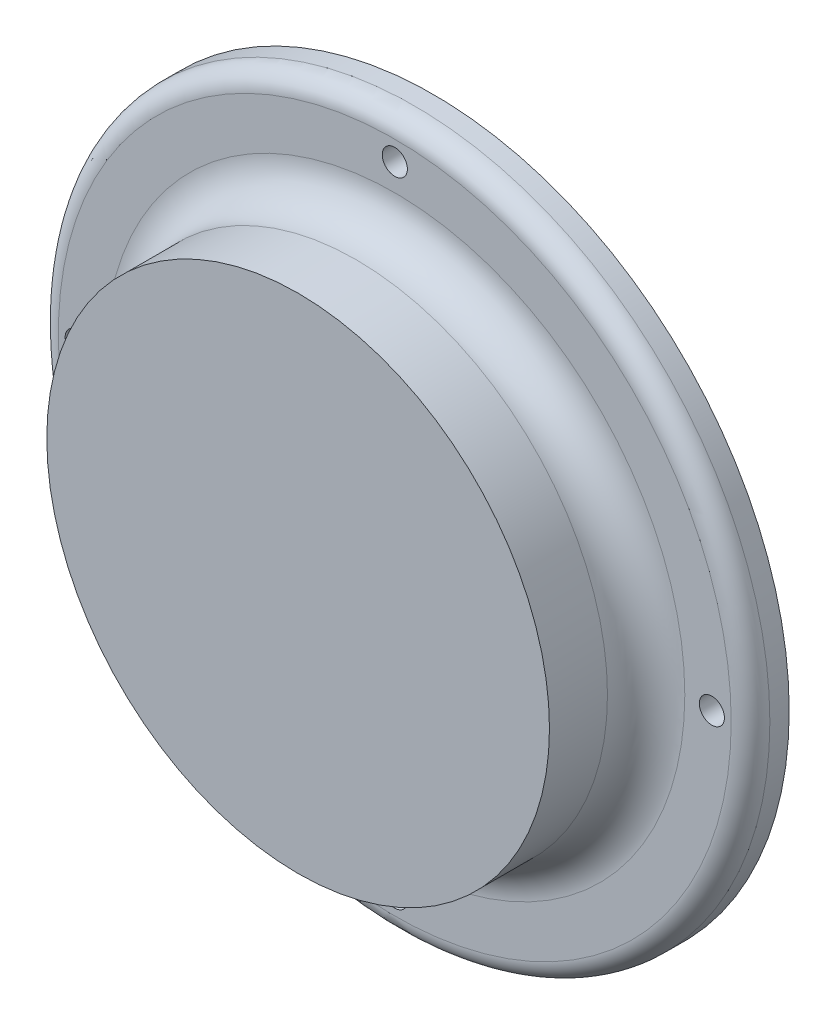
from build123d import *

# Parameters (mm, degrees)
ESQUISSE1_R                   = 92
EMBASE_DEPTH                  = 10
ARRONDI_5MM_R                 = 5
ESQUISSE2_R                   = 3.25
PER_AGES_6_5MM_DEPTH          = 131.491379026
ESQUISSE3_R                   = 65
CORPS_DEPTH                   = 25
CONG_10MM_R                   = 10
ESQUISSE4_R                   = 69
P_N_TRATION_CYLINDRIQUE_DEPTH = 7
CHANFREIN_1_5_SIZE            = 1.5


with BuildPart() as part:
    # Esquisse1 → Embase (new body)
    with BuildSketch(Plane.XY):
        Circle(ESQUISSE1_R)
    extrude(amount=EMBASE_DEPTH)

    # Arrondi-5mm
    arrondi_5mm_edges = [part.edges().sort_by_distance(p)[0] for p in [
        (-92, 0, 10),
    ]]
    fillet(arrondi_5mm_edges, radius=ARRONDI_5MM_R)

    # Esquisse2 → per_ages-6_5mm (cut, through all)
    with BuildSketch(Plane.XY.offset(10)):
        with Locations((0, 81.902736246)):
            Circle(ESQUISSE2_R)
        with Locations((-82, 0)):
            Circle(ESQUISSE2_R)
        with Locations((0, -82)):
            Circle(ESQUISSE2_R)
        with Locations((82, 0)):
            Circle(ESQUISSE2_R)
    extrude(amount=-PER_AGES_6_5MM_DEPTH, mode=Mode.SUBTRACT)

    # Esquisse3 → corps (add)
    with BuildSketch(Plane.XY.offset(10)):
        Circle(ESQUISSE3_R)
    extrude(amount=CORPS_DEPTH)

    # Cong_-10mm
    cong_10mm_edges = [part.edges().sort_by_distance(p)[0] for p in [
        (-65, 0, 10),
    ]]
    fillet(cong_10mm_edges, radius=CONG_10MM_R)

    # Esquisse4 → p_n_tration cylindrique (add)
    with BuildSketch(Plane.XY):
        Circle(ESQUISSE4_R)
    extrude(amount=-P_N_TRATION_CYLINDRIQUE_DEPTH)

    # Chanfrein-1.5
    chanfrein_1_5_edges = [part.edges().sort_by_distance(p)[0] for p in [
        (-69, 0, -7),
    ]]
    chamfer(chanfrein_1_5_edges, length=CHANFREIN_1_5_SIZE)


solid = part.part
